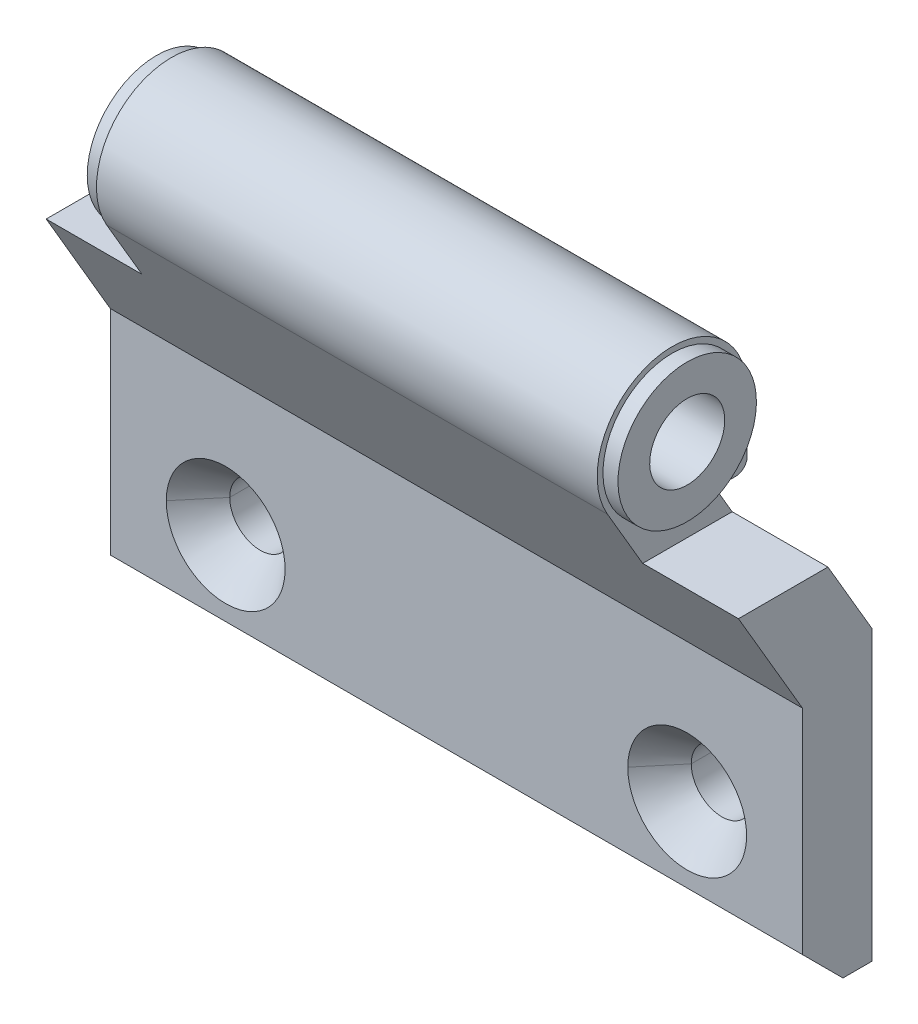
ISO-10303-21;
HEADER;
FILE_DESCRIPTION(('STEP AP214'),'2;1');
FILE_NAME('part.step','',(''),(''),'','','');
FILE_SCHEMA(('AUTOMOTIVE_DESIGN { 1 0 10303 214 1 1 1 1 }'));
ENDSEC;
DATA;
#1=APPLICATION_CONTEXT('core data for automotive mechanical design processes');
#2=APPLICATION_PROTOCOL_DEFINITION('international standard','automotive_design',2000,#1);
#3=PRODUCT_CONTEXT('',#1,'mechanical');
#4=PRODUCT('Part','Part','',(#3));
#5=PRODUCT_RELATED_PRODUCT_CATEGORY('part','',(#4));
#6=PRODUCT_DEFINITION_FORMATION('','',#4);
#7=PRODUCT_DEFINITION_CONTEXT('part definition',#1,'design');
#8=PRODUCT_DEFINITION('design','',#6,#7);
#9=PRODUCT_DEFINITION_SHAPE('','',#8);
#10=(LENGTH_UNIT() NAMED_UNIT(*) SI_UNIT(.MILLI.,.METRE.));
#11=(NAMED_UNIT(*) PLANE_ANGLE_UNIT() SI_UNIT($,.RADIAN.));
#12=(NAMED_UNIT(*) SI_UNIT($,.STERADIAN.) SOLID_ANGLE_UNIT());
#13=UNCERTAINTY_MEASURE_WITH_UNIT(LENGTH_MEASURE(1.E-05),#10,'distance_accuracy_value','');
#14=(GEOMETRIC_REPRESENTATION_CONTEXT(3) GLOBAL_UNCERTAINTY_ASSIGNED_CONTEXT((#13)) GLOBAL_UNIT_ASSIGNED_CONTEXT((#10,
#11,#12)) REPRESENTATION_CONTEXT('',''));
#15=CARTESIAN_POINT('',(0.,0.,0.));
#16=DIRECTION('',(0.,0.,1.));
#17=DIRECTION('',(1.,0.,0.));
#18=AXIS2_PLACEMENT_3D('',#15,#16,#17);
#19=CARTESIAN_POINT('',(40.,0.,6.3));
#20=DIRECTION('',(0.,0.,-1.));
#21=DIRECTION('',(-1.,0.,0.));
#22=AXIS2_PLACEMENT_3D('',#19,#20,#21);
#23=CYLINDRICAL_SURFACE('',#22,2.65);
#24=CARTESIAN_POINT('',(40.,0.,3.00000000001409));
#25=DIRECTION('',(0.,0.,1.));
#26=DIRECTION('',(-1.,0.,0.));
#27=AXIS2_PLACEMENT_3D('',#24,#25,#26);
#28=CIRCLE('',#27,2.64999999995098);
#29=CARTESIAN_POINT('',(42.6499999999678,0.,3.00000000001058));
#30=VERTEX_POINT('',#29);
#31=CARTESIAN_POINT('',(37.3500000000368,0.,3.00000000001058));
#32=VERTEX_POINT('',#31);
#33=EDGE_CURVE('E103',#30,#32,#28,.T.);
#34=ORIENTED_EDGE('',*,*,#33,.T.);
#35=DIRECTION('',(0.,0.,-1.));
#36=VECTOR('',#35,1.);
#37=CARTESIAN_POINT('',(37.35,0.,6.3));
#38=LINE('',#37,#36);
#39=CARTESIAN_POINT('',(37.35,0.,0.));
#40=VERTEX_POINT('',#39);
#41=EDGE_CURVE('E110',#32,#40,#38,.T.);
#42=ORIENTED_EDGE('',*,*,#41,.T.);
#43=CARTESIAN_POINT('',(40.,0.,0.));
#44=DIRECTION('',(0.,0.,-1.));
#45=DIRECTION('',(-1.,0.,0.));
#46=AXIS2_PLACEMENT_3D('',#43,#44,#45);
#47=CIRCLE('',#46,2.65);
#48=CARTESIAN_POINT('',(42.65,0.,0.));
#49=VERTEX_POINT('',#48);
#50=EDGE_CURVE('E88',#49,#40,#47,.F.);
#51=ORIENTED_EDGE('',*,*,#50,.F.);
#52=DIRECTION('',(0.,0.,-1.));
#53=VECTOR('',#52,1.);
#54=CARTESIAN_POINT('',(42.65,0.,6.3));
#55=LINE('',#54,#53);
#56=EDGE_CURVE('E105',#49,#30,#55,.F.);
#57=ORIENTED_EDGE('',*,*,#56,.T.);
#58=EDGE_LOOP('',(#34,#42,#51,#57));
#59=FACE_BOUND('',#58,.T.);
#60=ADVANCED_FACE('F14',(#59),#23,.F.);
#61=CARTESIAN_POINT('',(40.,0.,6.3));
#62=DIRECTION('',(0.,0.,-1.));
#63=DIRECTION('',(-1.,0.,0.));
#64=AXIS2_PLACEMENT_3D('',#61,#62,#63);
#65=CYLINDRICAL_SURFACE('',#64,2.65);
#66=CARTESIAN_POINT('',(40.,0.,3.00000000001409));
#67=DIRECTION('',(0.,0.,1.));
#68=DIRECTION('',(-1.,0.,0.));
#69=AXIS2_PLACEMENT_3D('',#66,#67,#68);
#70=CIRCLE('',#69,2.64999999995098);
#71=EDGE_CURVE('E115',#32,#30,#70,.T.);
#72=ORIENTED_EDGE('',*,*,#71,.T.);
#73=ORIENTED_EDGE('',*,*,#56,.F.);
#74=CARTESIAN_POINT('',(40.,0.,0.));
#75=DIRECTION('',(0.,0.,-1.));
#76=DIRECTION('',(-1.,0.,0.));
#77=AXIS2_PLACEMENT_3D('',#74,#75,#76);
#78=CIRCLE('',#77,2.65);
#79=EDGE_CURVE('E231',#40,#49,#78,.F.);
#80=ORIENTED_EDGE('',*,*,#79,.F.);
#81=ORIENTED_EDGE('',*,*,#41,.F.);
#82=EDGE_LOOP('',(#72,#73,#80,#81));
#83=FACE_BOUND('',#82,.T.);
#84=ADVANCED_FACE('F116',(#83),#65,.F.);
#85=CARTESIAN_POINT('',(0.,0.,6.3));
#86=DIRECTION('',(0.,0.,1.));
#87=DIRECTION('',(1.,0.,0.));
#88=AXIS2_PLACEMENT_3D('',#85,#86,#87);
#89=CYLINDRICAL_SURFACE('',#88,2.65);
#90=CARTESIAN_POINT('',(0.,0.,3.00000000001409));
#91=DIRECTION('',(0.,0.,1.));
#92=DIRECTION('',(-1.,0.,0.));
#93=AXIS2_PLACEMENT_3D('',#90,#91,#92);
#94=CIRCLE('',#93,2.65000000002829);
#95=CARTESIAN_POINT('',(2.6499999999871,0.,2.99999999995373));
#96=VERTEX_POINT('',#95);
#97=CARTESIAN_POINT('',(-2.6499999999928,0.,2.99999999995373));
#98=VERTEX_POINT('',#97);
#99=EDGE_CURVE('E132',#96,#98,#94,.T.);
#100=ORIENTED_EDGE('',*,*,#99,.T.);
#101=DIRECTION('',(0.,0.,1.));
#102=VECTOR('',#101,1.);
#103=CARTESIAN_POINT('',(-2.65,0.,6.3));
#104=LINE('',#103,#102);
#105=CARTESIAN_POINT('',(-2.65,0.,0.));
#106=VERTEX_POINT('',#105);
#107=EDGE_CURVE('E126',#98,#106,#104,.F.);
#108=ORIENTED_EDGE('',*,*,#107,.T.);
#109=CARTESIAN_POINT('',(0.,0.,0.));
#110=DIRECTION('',(0.,0.,1.));
#111=DIRECTION('',(1.,0.,0.));
#112=AXIS2_PLACEMENT_3D('',#109,#110,#111);
#113=CIRCLE('',#112,2.65);
#114=CARTESIAN_POINT('',(2.65,0.,0.));
#115=VERTEX_POINT('',#114);
#116=EDGE_CURVE('E228',#115,#106,#113,.T.);
#117=ORIENTED_EDGE('',*,*,#116,.F.);
#118=DIRECTION('',(0.,0.,1.));
#119=VECTOR('',#118,1.);
#120=CARTESIAN_POINT('',(2.65,0.,6.3));
#121=LINE('',#120,#119);
#122=EDGE_CURVE('E96',#115,#96,#121,.T.);
#123=ORIENTED_EDGE('',*,*,#122,.T.);
#124=EDGE_LOOP('',(#100,#108,#117,#123));
#125=FACE_BOUND('',#124,.T.);
#126=ADVANCED_FACE('F805',(#125),#89,.F.);
#127=CARTESIAN_POINT('',(0.,0.,6.3));
#128=DIRECTION('',(0.,0.,1.));
#129=DIRECTION('',(1.,0.,0.));
#130=AXIS2_PLACEMENT_3D('',#127,#128,#129);
#131=CYLINDRICAL_SURFACE('',#130,2.65);
#132=CARTESIAN_POINT('',(0.,0.,3.00000000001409));
#133=DIRECTION('',(0.,0.,1.));
#134=DIRECTION('',(-1.,0.,0.));
#135=AXIS2_PLACEMENT_3D('',#132,#133,#134);
#136=CIRCLE('',#135,2.65000000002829);
#137=EDGE_CURVE('E195',#98,#96,#136,.T.);
#138=ORIENTED_EDGE('',*,*,#137,.T.);
#139=ORIENTED_EDGE('',*,*,#122,.F.);
#140=CARTESIAN_POINT('',(0.,0.,0.));
#141=DIRECTION('',(0.,0.,1.));
#142=DIRECTION('',(1.,0.,0.));
#143=AXIS2_PLACEMENT_3D('',#140,#141,#142);
#144=CIRCLE('',#143,2.65);
#145=EDGE_CURVE('E190',#106,#115,#144,.T.);
#146=ORIENTED_EDGE('',*,*,#145,.F.);
#147=ORIENTED_EDGE('',*,*,#107,.F.);
#148=EDGE_LOOP('',(#138,#139,#146,#147));
#149=FACE_BOUND('',#148,.T.);
#150=ADVANCED_FACE('F350',(#149),#131,.F.);
#151=CARTESIAN_POINT('',(50.,-6.5,6.));
#152=DIRECTION('',(0.,-1.,0.));
#153=DIRECTION('',(-1.,0.,0.));
#154=AXIS2_PLACEMENT_3D('',#151,#152,#153);
#155=PLANE('',#154);
#156=DIRECTION('',(1.,0.,0.));
#157=VECTOR('',#156,1.);
#158=CARTESIAN_POINT('',(33.,-6.5,3.5));
#159=LINE('',#158,#157);
#160=CARTESIAN_POINT('',(7.,-6.5,3.5));
#161=VERTEX_POINT('',#160);
#162=CARTESIAN_POINT('',(33.,-6.5,3.5));
#163=VERTEX_POINT('',#162);
#164=EDGE_CURVE('E184',#161,#163,#159,.T.);
#165=ORIENTED_EDGE('',*,*,#164,.T.);
#166=DIRECTION('',(0.,0.,-1.));
#167=VECTOR('',#166,1.);
#168=CARTESIAN_POINT('',(33.,-6.5,0.));
#169=LINE('',#168,#167);
#170=CARTESIAN_POINT('',(33.,-6.5,0.));
#171=VERTEX_POINT('',#170);
#172=EDGE_CURVE('E181',#163,#171,#169,.T.);
#173=ORIENTED_EDGE('',*,*,#172,.T.);
#174=DIRECTION('',(-1.,0.,0.));
#175=VECTOR('',#174,1.);
#176=CARTESIAN_POINT('',(50.,-6.5,0.));
#177=LINE('',#176,#175);
#178=CARTESIAN_POINT('',(7.,-6.5,0.));
#179=VERTEX_POINT('',#178);
#180=EDGE_CURVE('E157',#179,#171,#177,.F.);
#181=ORIENTED_EDGE('',*,*,#180,.F.);
#182=DIRECTION('',(0.,0.,-1.));
#183=VECTOR('',#182,1.);
#184=CARTESIAN_POINT('',(7.,-6.5,3.5));
#185=LINE('',#184,#183);
#186=EDGE_CURVE('E163',#179,#161,#185,.F.);
#187=ORIENTED_EDGE('',*,*,#186,.T.);
#188=EDGE_LOOP('',(#165,#173,#181,#187));
#189=FACE_BOUND('',#188,.T.);
#190=ADVANCED_FACE('F264',(#189),#155,.F.);
#191=CARTESIAN_POINT('',(40.,0.,6.));
#192=DIRECTION('',(0.,0.,1.));
#193=DIRECTION('',(1.,0.,0.));
#194=AXIS2_PLACEMENT_3D('',#191,#192,#193);
#195=CONICAL_SURFACE('',#194,5.1499999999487,0.694738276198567);
#196=ORIENTED_EDGE('',*,*,#33,.F.);
#197=DIRECTION('',(-0.640184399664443,0.,-0.768221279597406));
#198=VECTOR('',#197,1.);
#199=CARTESIAN_POINT('',(415878.483333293,-5.09314812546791E-11,499006.));
#200=LINE('',#199,#198);
#201=CARTESIAN_POINT('',(45.1499999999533,0.,6.));
#202=VERTEX_POINT('',#201);
#203=EDGE_CURVE('E120',#30,#202,#200,.F.);
#204=ORIENTED_EDGE('',*,*,#203,.T.);
#205=CARTESIAN_POINT('',(40.,0.,6.));
#206=DIRECTION('',(0.,0.,1.));
#207=DIRECTION('',(1.,0.,0.));
#208=AXIS2_PLACEMENT_3D('',#205,#206,#207);
#209=CIRCLE('',#208,5.1499999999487);
#210=CARTESIAN_POINT('',(34.8500000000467,0.,6.));
#211=VERTEX_POINT('',#210);
#212=EDGE_CURVE('E219',#211,#202,#209,.F.);
#213=ORIENTED_EDGE('',*,*,#212,.F.);
#214=DIRECTION('',(0.640184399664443,0.,-0.768221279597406));
#215=VECTOR('',#214,1.);
#216=CARTESIAN_POINT('',(-415798.483333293,0.,499006.));
#217=LINE('',#216,#215);
#218=EDGE_CURVE('E121',#211,#32,#217,.T.);
#219=ORIENTED_EDGE('',*,*,#218,.T.);
#220=EDGE_LOOP('',(#196,#204,#213,#219));
#221=FACE_BOUND('',#220,.T.);
#222=ADVANCED_FACE('F124',(#221),#195,.F.);
#223=CARTESIAN_POINT('',(40.,0.,6.));
#224=DIRECTION('',(0.,0.,1.));
#225=DIRECTION('',(1.,0.,0.));
#226=AXIS2_PLACEMENT_3D('',#223,#224,#225);
#227=CONICAL_SURFACE('',#226,5.1499999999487,0.694738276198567);
#228=ORIENTED_EDGE('',*,*,#71,.F.);
#229=ORIENTED_EDGE('',*,*,#218,.F.);
#230=CARTESIAN_POINT('',(40.,0.,6.));
#231=DIRECTION('',(0.,0.,1.));
#232=DIRECTION('',(1.,0.,0.));
#233=AXIS2_PLACEMENT_3D('',#230,#231,#232);
#234=CIRCLE('',#233,5.1499999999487);
#235=EDGE_CURVE('E130',#202,#211,#234,.F.);
#236=ORIENTED_EDGE('',*,*,#235,.F.);
#237=ORIENTED_EDGE('',*,*,#203,.F.);
#238=EDGE_LOOP('',(#228,#229,#236,#237));
#239=FACE_BOUND('',#238,.T.);
#240=ADVANCED_FACE('F128',(#239),#227,.F.);
#241=CARTESIAN_POINT('',(0.,0.,5.99999999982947));
#242=DIRECTION('',(0.,0.,1.));
#243=DIRECTION('',(1.,0.,0.));
#244=AXIS2_PLACEMENT_3D('',#241,#242,#243);
#245=CONICAL_SURFACE('',#244,5.14999999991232,0.694738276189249);
#246=ORIENTED_EDGE('',*,*,#99,.F.);
#247=DIRECTION('',(-0.640184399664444,0.,-0.768221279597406));
#248=VECTOR('',#247,1.);
#249=CARTESIAN_POINT('',(415838.483333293,-5.09210729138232E-11,499006.));
#250=LINE('',#249,#248);
#251=CARTESIAN_POINT('',(5.15000000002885,0.,6.));
#252=VERTEX_POINT('',#251);
#253=EDGE_CURVE('E197',#96,#252,#250,.F.);
#254=ORIENTED_EDGE('',*,*,#253,.T.);
#255=CARTESIAN_POINT('',(0.,0.,6.));
#256=DIRECTION('',(0.,0.,1.));
#257=DIRECTION('',(1.,0.,0.));
#258=AXIS2_PLACEMENT_3D('',#255,#256,#257);
#259=CIRCLE('',#258,5.15000000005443);
#260=CARTESIAN_POINT('',(-5.15000000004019,0.,6.));
#261=VERTEX_POINT('',#260);
#262=EDGE_CURVE('E215',#261,#252,#259,.F.);
#263=ORIENTED_EDGE('',*,*,#262,.F.);
#264=DIRECTION('',(0.640184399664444,0.,-0.768221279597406));
#265=VECTOR('',#264,1.);
#266=CARTESIAN_POINT('',(-415838.483333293,0.,499006.));
#267=LINE('',#266,#265);
#268=EDGE_CURVE('E134',#261,#98,#267,.T.);
#269=ORIENTED_EDGE('',*,*,#268,.T.);
#270=EDGE_LOOP('',(#246,#254,#263,#269));
#271=FACE_BOUND('',#270,.T.);
#272=ADVANCED_FACE('F343',(#271),#245,.F.);
#273=CARTESIAN_POINT('',(0.,0.,5.99999999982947));
#274=DIRECTION('',(0.,0.,1.));
#275=DIRECTION('',(1.,0.,0.));
#276=AXIS2_PLACEMENT_3D('',#273,#274,#275);
#277=CONICAL_SURFACE('',#276,5.14999999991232,0.694738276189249);
#278=ORIENTED_EDGE('',*,*,#137,.F.);
#279=ORIENTED_EDGE('',*,*,#268,.F.);
#280=CARTESIAN_POINT('',(0.,0.,6.));
#281=DIRECTION('',(0.,0.,1.));
#282=DIRECTION('',(1.,0.,0.));
#283=AXIS2_PLACEMENT_3D('',#280,#281,#282);
#284=CIRCLE('',#283,5.15000000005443);
#285=EDGE_CURVE('E211',#252,#261,#284,.F.);
#286=ORIENTED_EDGE('',*,*,#285,.F.);
#287=ORIENTED_EDGE('',*,*,#253,.F.);
#288=EDGE_LOOP('',(#278,#279,#286,#287));
#289=FACE_BOUND('',#288,.T.);
#290=ADVANCED_FACE('F351',(#289),#277,.F.);
#291=CARTESIAN_POINT('',(50.,-10.,0.));
#292=DIRECTION('',(0.,-1.,0.));
#293=DIRECTION('',(-1.,0.,0.));
#294=AXIS2_PLACEMENT_3D('',#291,#292,#293);
#295=PLANE('',#294);
#296=DIRECTION('',(-1.,0.,0.));
#297=VECTOR('',#296,1.);
#298=CARTESIAN_POINT('',(50.,-10.,0.));
#299=LINE('',#298,#297);
#300=CARTESIAN_POINT('',(50.,-10.,0.));
#301=VERTEX_POINT('',#300);
#302=CARTESIAN_POINT('',(-10.,-10.,0.));
#303=VERTEX_POINT('',#302);
#304=EDGE_CURVE('E160',#301,#303,#299,.T.);
#305=ORIENTED_EDGE('',*,*,#304,.F.);
#306=DIRECTION('',(0.,0.,-1.));
#307=VECTOR('',#306,1.);
#308=CARTESIAN_POINT('',(50.,-10.,6.));
#309=LINE('',#308,#307);
#310=CARTESIAN_POINT('',(50.,-10.,2.5));
#311=VERTEX_POINT('',#310);
#312=EDGE_CURVE('E280',#301,#311,#309,.F.);
#313=ORIENTED_EDGE('',*,*,#312,.T.);
#314=DIRECTION('',(-1.,0.,0.));
#315=VECTOR('',#314,1.);
#316=CARTESIAN_POINT('',(50.,-10.,2.5));
#317=LINE('',#316,#315);
#318=CARTESIAN_POINT('',(-10.,-10.,2.5));
#319=VERTEX_POINT('',#318);
#320=EDGE_CURVE('E323',#319,#311,#317,.F.);
#321=ORIENTED_EDGE('',*,*,#320,.F.);
#322=DIRECTION('',(0.,0.,-1.));
#323=VECTOR('',#322,1.);
#324=CARTESIAN_POINT('',(-10.,-10.,6.));
#325=LINE('',#324,#323);
#326=EDGE_CURVE('E149',#303,#319,#325,.F.);
#327=ORIENTED_EDGE('',*,*,#326,.F.);
#328=EDGE_LOOP('',(#305,#313,#321,#327));
#329=FACE_BOUND('',#328,.T.);
#330=ADVANCED_FACE('F523',(#329),#295,.T.);
#331=CARTESIAN_POINT('',(50.,-6.5,6.));
#332=DIRECTION('',(0.,-0.707106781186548,0.707106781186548));
#333=DIRECTION('',(0.,0.707106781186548,0.707106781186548));
#334=AXIS2_PLACEMENT_3D('',#331,#332,#333);
#335=PLANE('',#334);
#336=DIRECTION('',(0.,0.707106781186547,0.707106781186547));
#337=VECTOR('',#336,1.);
#338=CARTESIAN_POINT('',(50.,-10.,2.5));
#339=LINE('',#338,#337);
#340=CARTESIAN_POINT('',(50.,-6.5,6.));
#341=VERTEX_POINT('',#340);
#342=EDGE_CURVE('E317',#311,#341,#339,.T.);
#343=ORIENTED_EDGE('',*,*,#342,.T.);
#344=DIRECTION('',(1.,0.,0.));
#345=VECTOR('',#344,1.);
#346=CARTESIAN_POINT('',(50.,-6.5,6.));
#347=LINE('',#346,#345);
#348=CARTESIAN_POINT('',(-10.,-6.5,6.));
#349=VERTEX_POINT('',#348);
#350=EDGE_CURVE('E221',#349,#341,#347,.T.);
#351=ORIENTED_EDGE('',*,*,#350,.F.);
#352=DIRECTION('',(0.,0.707106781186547,0.707106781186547));
#353=VECTOR('',#352,1.);
#354=CARTESIAN_POINT('',(-10.,-10.,2.5));
#355=LINE('',#354,#353);
#356=EDGE_CURVE('E145',#319,#349,#355,.T.);
#357=ORIENTED_EDGE('',*,*,#356,.F.);
#358=ORIENTED_EDGE('',*,*,#320,.T.);
#359=EDGE_LOOP('',(#343,#351,#357,#358));
#360=FACE_BOUND('',#359,.T.);
#361=ADVANCED_FACE('F237',(#360),#335,.T.);
#362=CARTESIAN_POINT('',(50.,15.,0.));
#363=DIRECTION('',(0.,0.,-1.));
#364=DIRECTION('',(-1.,0.,0.));
#365=AXIS2_PLACEMENT_3D('',#362,#363,#364);
#366=PLANE('',#365);
#367=ORIENTED_EDGE('',*,*,#116,.T.);
#368=ORIENTED_EDGE('',*,*,#145,.T.);
#369=EDGE_LOOP('',(#367,#368));
#370=FACE_BOUND('',#369,.T.);
#371=ORIENTED_EDGE('',*,*,#50,.T.);
#372=ORIENTED_EDGE('',*,*,#79,.T.);
#373=EDGE_LOOP('',(#371,#372));
#374=FACE_BOUND('',#373,.T.);
#375=DIRECTION('',(0.,1.,0.));
#376=VECTOR('',#375,1.);
#377=CARTESIAN_POINT('',(7.,-6.5,0.));
#378=LINE('',#377,#376);
#379=CARTESIAN_POINT('',(7.,15.,-3.0964814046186E-13));
#380=VERTEX_POINT('',#379);
#381=EDGE_CURVE('E167',#380,#179,#378,.F.);
#382=ORIENTED_EDGE('',*,*,#381,.T.);
#383=ORIENTED_EDGE('',*,*,#180,.T.);
#384=DIRECTION('',(0.,-1.,0.));
#385=VECTOR('',#384,1.);
#386=CARTESIAN_POINT('',(33.,-6.5,0.));
#387=LINE('',#386,#385);
#388=CARTESIAN_POINT('',(33.,15.,-1.196959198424E-13));
#389=VERTEX_POINT('',#388);
#390=EDGE_CURVE('E185',#171,#389,#387,.F.);
#391=ORIENTED_EDGE('',*,*,#390,.T.);
#392=DIRECTION('',(-1.,0.,0.));
#393=VECTOR('',#392,1.);
#394=CARTESIAN_POINT('',(50.,15.,-4.70110061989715E-13));
#395=LINE('',#394,#393);
#396=CARTESIAN_POINT('',(50.,15.,-3.0964814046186E-13));
#397=VERTEX_POINT('',#396);
#398=EDGE_CURVE('E283',#397,#389,#395,.T.);
#399=ORIENTED_EDGE('',*,*,#398,.F.);
#400=DIRECTION('',(0.,1.,0.));
#401=VECTOR('',#400,1.);
#402=CARTESIAN_POINT('',(50.,-10.,0.));
#403=LINE('',#402,#401);
#404=EDGE_CURVE('E214',#397,#301,#403,.F.);
#405=ORIENTED_EDGE('',*,*,#404,.T.);
#406=ORIENTED_EDGE('',*,*,#304,.T.);
#407=DIRECTION('',(0.,1.,0.));
#408=VECTOR('',#407,1.);
#409=CARTESIAN_POINT('',(-10.,-10.,0.));
#410=LINE('',#409,#408);
#411=CARTESIAN_POINT('',(-10.,15.,-3.0964814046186E-13));
#412=VERTEX_POINT('',#411);
#413=EDGE_CURVE('E154',#412,#303,#410,.F.);
#414=ORIENTED_EDGE('',*,*,#413,.F.);
#415=DIRECTION('',(-1.,0.,0.));
#416=VECTOR('',#415,1.);
#417=CARTESIAN_POINT('',(50.,15.,-4.70110061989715E-13));
#418=LINE('',#417,#416);
#419=EDGE_CURVE('E249',#380,#412,#418,.T.);
#420=ORIENTED_EDGE('',*,*,#419,.F.);
#421=EDGE_LOOP('',(#382,#383,#391,#399,#405,#406,#414,#420));
#422=FACE_BOUND('',#421,.T.);
#423=ADVANCED_FACE('F233',(#370,#374,#422),#366,.T.);
#424=CARTESIAN_POINT('',(33.,-6.5,0.));
#425=DIRECTION('',(1.,0.,0.));
#426=DIRECTION('',(0.,-1.,0.));
#427=AXIS2_PLACEMENT_3D('',#424,#425,#426);
#428=PLANE('',#427);
#429=DIRECTION('',(0.,1.,0.));
#430=VECTOR('',#429,1.);
#431=CARTESIAN_POINT('',(33.,-6.5,3.5));
#432=LINE('',#431,#430);
#433=CARTESIAN_POINT('',(33.,20.9825319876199,3.50000000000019));
#434=VERTEX_POINT('',#433);
#435=EDGE_CURVE('E256',#163,#434,#432,.T.);
#436=ORIENTED_EDGE('',*,*,#435,.T.);
#437=DIRECTION('',(0.,-0.863138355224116,-0.504967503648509));
#438=VECTOR('',#437,1.);
#439=CARTESIAN_POINT('',(33.,24.,5.2653291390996));
#440=LINE('',#439,#438);
#441=EDGE_CURVE('E286',#389,#434,#440,.F.);
#442=ORIENTED_EDGE('',*,*,#441,.F.);
#443=ORIENTED_EDGE('',*,*,#390,.F.);
#444=ORIENTED_EDGE('',*,*,#172,.F.);
#445=EDGE_LOOP('',(#436,#442,#443,#444));
#446=FACE_BOUND('',#445,.T.);
#447=ADVANCED_FACE('F236',(#446),#428,.F.);
#448=CARTESIAN_POINT('',(33.,-6.5,3.5));
#449=DIRECTION('',(0.,0.,1.));
#450=DIRECTION('',(1.,0.,0.));
#451=AXIS2_PLACEMENT_3D('',#448,#449,#450);
#452=PLANE('',#451);
#453=ORIENTED_EDGE('',*,*,#164,.F.);
#454=DIRECTION('',(0.,1.,0.));
#455=VECTOR('',#454,1.);
#456=CARTESIAN_POINT('',(7.,-6.5,3.5));
#457=LINE('',#456,#455);
#458=CARTESIAN_POINT('',(7.,20.9825319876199,3.50000000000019));
#459=VERTEX_POINT('',#458);
#460=EDGE_CURVE('E166',#161,#459,#457,.T.);
#461=ORIENTED_EDGE('',*,*,#460,.T.);
#462=DIRECTION('',(-1.,0.,0.));
#463=VECTOR('',#462,1.);
#464=CARTESIAN_POINT('',(50.,20.9825319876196,3.50000000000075));
#465=LINE('',#464,#463);
#466=EDGE_CURVE('E309',#434,#459,#465,.T.);
#467=ORIENTED_EDGE('',*,*,#466,.F.);
#468=ORIENTED_EDGE('',*,*,#435,.F.);
#469=EDGE_LOOP('',(#453,#461,#467,#468));
#470=FACE_BOUND('',#469,.T.);
#471=ADVANCED_FACE('F270',(#470),#452,.F.);
#472=CARTESIAN_POINT('',(7.,-6.5,3.5));
#473=DIRECTION('',(-1.,0.,0.));
#474=DIRECTION('',(0.,1.,0.));
#475=AXIS2_PLACEMENT_3D('',#472,#473,#474);
#476=PLANE('',#475);
#477=ORIENTED_EDGE('',*,*,#460,.F.);
#478=ORIENTED_EDGE('',*,*,#186,.F.);
#479=ORIENTED_EDGE('',*,*,#381,.F.);
#480=DIRECTION('',(0.,-0.863138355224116,-0.504967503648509));
#481=VECTOR('',#480,1.);
#482=CARTESIAN_POINT('',(7.,24.,5.2653291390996));
#483=LINE('',#482,#481);
#484=EDGE_CURVE('E306',#459,#380,#483,.T.);
#485=ORIENTED_EDGE('',*,*,#484,.F.);
#486=EDGE_LOOP('',(#477,#478,#479,#485));
#487=FACE_BOUND('',#486,.T.);
#488=ADVANCED_FACE('F259',(#487),#476,.F.);
#489=CARTESIAN_POINT('',(-10.12123523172,25.,3.5));
#490=DIRECTION('',(1.,0.,0.));
#491=DIRECTION('',(0.,-1.,0.));
#492=AXIS2_PLACEMENT_3D('',#489,#490,#491);
#493=CYLINDRICAL_SURFACE('',#492,1.);
#494=DIRECTION('',(-1.,0.,0.));
#495=VECTOR('',#494,1.);
#496=CARTESIAN_POINT('',(50.,25.,2.5));
#497=LINE('',#496,#495);
#498=CARTESIAN_POINT('',(41.7,25.,2.5));
#499=VERTEX_POINT('',#498);
#500=CARTESIAN_POINT('',(-1.7,25.,2.5));
#501=VERTEX_POINT('',#500);
#502=EDGE_CURVE('E415',#499,#501,#497,.T.);
#503=ORIENTED_EDGE('',*,*,#502,.F.);
#504=CARTESIAN_POINT('',(41.7,25.,3.5));
#505=DIRECTION('',(1.,0.,0.));
#506=DIRECTION('',(0.,-1.,0.));
#507=AXIS2_PLACEMENT_3D('',#504,#505,#506);
#508=CIRCLE('',#507,1.);
#509=CARTESIAN_POINT('',(41.7,24.,3.5));
#510=VERTEX_POINT('',#509);
#511=EDGE_CURVE('E222',#499,#510,#508,.F.);
#512=ORIENTED_EDGE('',*,*,#511,.T.);
#513=DIRECTION('',(-1.,0.,0.));
#514=VECTOR('',#513,1.);
#515=CARTESIAN_POINT('',(50.,24.,3.5));
#516=LINE('',#515,#514);
#517=CARTESIAN_POINT('',(-1.7,24.,3.5));
#518=VERTEX_POINT('',#517);
#519=EDGE_CURVE('E301',#518,#510,#516,.F.);
#520=ORIENTED_EDGE('',*,*,#519,.F.);
#521=CARTESIAN_POINT('',(-1.7,25.,3.5));
#522=DIRECTION('',(1.,0.,0.));
#523=DIRECTION('',(0.,-1.,0.));
#524=AXIS2_PLACEMENT_3D('',#521,#522,#523);
#525=CIRCLE('',#524,1.);
#526=EDGE_CURVE('E224',#518,#501,#525,.T.);
#527=ORIENTED_EDGE('',*,*,#526,.T.);
#528=EDGE_LOOP('',(#503,#512,#520,#527));
#529=FACE_BOUND('',#528,.T.);
#530=ADVANCED_FACE('F566',(#529),#493,.T.);
#531=CARTESIAN_POINT('',(-1.7,21.5,-1.550040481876));
#532=DIRECTION('',(0.,-1.,0.));
#533=DIRECTION('',(-1.,0.,0.));
#534=AXIS2_PLACEMENT_3D('',#531,#532,#533);
#535=PLANE('',#534);
#536=DIRECTION('',(0.,0.,-1.));
#537=VECTOR('',#536,1.);
#538=CARTESIAN_POINT('',(-1.7,21.5,-1.550040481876));
#539=LINE('',#538,#537);
#540=CARTESIAN_POINT('',(-1.7,21.5,11.5578474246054));
#541=VERTEX_POINT('',#540);
#542=CARTESIAN_POINT('',(-1.7,21.5,3.80273771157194));
#543=VERTEX_POINT('',#542);
#544=EDGE_CURVE('E411',#541,#543,#539,.T.);
#545=ORIENTED_EDGE('',*,*,#544,.T.);
#546=DIRECTION('',(-1.,0.,0.));
#547=VECTOR('',#546,1.);
#548=CARTESIAN_POINT('',(50.,21.5,3.80273771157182));
#549=LINE('',#548,#547);
#550=CARTESIAN_POINT('',(-10.,21.5,3.80273771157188));
#551=VERTEX_POINT('',#550);
#552=EDGE_CURVE('E293',#551,#543,#549,.F.);
#553=ORIENTED_EDGE('',*,*,#552,.F.);
#554=DIRECTION('',(0.,0.,-1.));
#555=VECTOR('',#554,1.);
#556=CARTESIAN_POINT('',(-10.,21.5,6.));
#557=LINE('',#556,#555);
#558=CARTESIAN_POINT('',(-10.,21.5,11.5578474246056));
#559=VERTEX_POINT('',#558);
#560=EDGE_CURVE('E148',#559,#551,#557,.T.);
#561=ORIENTED_EDGE('',*,*,#560,.F.);
#562=DIRECTION('',(-1.,0.,0.));
#563=VECTOR('',#562,1.);
#564=CARTESIAN_POINT('',(50.,21.4999999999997,11.5578474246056));
#565=LINE('',#564,#563);
#566=EDGE_CURVE('E399',#541,#559,#565,.T.);
#567=ORIENTED_EDGE('',*,*,#566,.F.);
#568=EDGE_LOOP('',(#545,#553,#561,#567));
#569=FACE_BOUND('',#568,.T.);
#570=ADVANCED_FACE('F574',(#569),#535,.F.);
#571=CARTESIAN_POINT('',(-10.,-10.,6.));
#572=DIRECTION('',(-1.,0.,0.));
#573=DIRECTION('',(0.,1.,0.));
#574=AXIS2_PLACEMENT_3D('',#571,#572,#573);
#575=PLANE('',#574);
#576=DIRECTION('',(0.,0.863138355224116,0.504967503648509));
#577=VECTOR('',#576,1.);
#578=CARTESIAN_POINT('',(-10.,12.,6.));
#579=LINE('',#578,#577);
#580=CARTESIAN_POINT('',(-10.,12.,6.));
#581=VERTEX_POINT('',#580);
#582=EDGE_CURVE('E391',#559,#581,#579,.F.);
#583=ORIENTED_EDGE('',*,*,#582,.F.);
#584=ORIENTED_EDGE('',*,*,#560,.T.);
#585=DIRECTION('',(0.,-0.863138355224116,-0.504967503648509));
#586=VECTOR('',#585,1.);
#587=CARTESIAN_POINT('',(-10.,24.,5.2653291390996));
#588=LINE('',#587,#586);
#589=EDGE_CURVE('E290',#412,#551,#588,.F.);
#590=ORIENTED_EDGE('',*,*,#589,.F.);
#591=ORIENTED_EDGE('',*,*,#413,.T.);
#592=ORIENTED_EDGE('',*,*,#326,.T.);
#593=ORIENTED_EDGE('',*,*,#356,.T.);
#594=DIRECTION('',(0.,1.,0.));
#595=VECTOR('',#594,1.);
#596=CARTESIAN_POINT('',(-10.,-10.,6.));
#597=LINE('',#596,#595);
#598=EDGE_CURVE('E314',#581,#349,#597,.F.);
#599=ORIENTED_EDGE('',*,*,#598,.F.);
#600=EDGE_LOOP('',(#583,#584,#590,#591,#592,#593,#599));
#601=FACE_BOUND('',#600,.T.);
#602=ADVANCED_FACE('F357',(#601),#575,.T.);
#603=CARTESIAN_POINT('',(50.,-10.,6.));
#604=DIRECTION('',(0.,0.,1.));
#605=DIRECTION('',(1.,0.,0.));
#606=AXIS2_PLACEMENT_3D('',#603,#604,#605);
#607=PLANE('',#606);
#608=ORIENTED_EDGE('',*,*,#262,.T.);
#609=ORIENTED_EDGE('',*,*,#285,.T.);
#610=EDGE_LOOP('',(#608,#609));
#611=FACE_BOUND('',#610,.T.);
#612=ORIENTED_EDGE('',*,*,#212,.T.);
#613=ORIENTED_EDGE('',*,*,#235,.T.);
#614=EDGE_LOOP('',(#612,#613));
#615=FACE_BOUND('',#614,.T.);
#616=ORIENTED_EDGE('',*,*,#350,.T.);
#617=DIRECTION('',(0.,1.,0.));
#618=VECTOR('',#617,1.);
#619=CARTESIAN_POINT('',(50.,-10.,6.));
#620=LINE('',#619,#618);
#621=CARTESIAN_POINT('',(50.,12.,6.));
#622=VERTEX_POINT('',#621);
#623=EDGE_CURVE('E320',#341,#622,#620,.T.);
#624=ORIENTED_EDGE('',*,*,#623,.T.);
#625=DIRECTION('',(-1.,0.,0.));
#626=VECTOR('',#625,1.);
#627=CARTESIAN_POINT('',(50.,12.,6.));
#628=LINE('',#627,#626);
#629=EDGE_CURVE('E389',#581,#622,#628,.F.);
#630=ORIENTED_EDGE('',*,*,#629,.F.);
#631=ORIENTED_EDGE('',*,*,#598,.T.);
#632=EDGE_LOOP('',(#616,#624,#630,#631));
#633=FACE_BOUND('',#632,.T.);
#634=ADVANCED_FACE('F353',(#611,#615,#633),#607,.T.);
#635=CARTESIAN_POINT('',(50.,-10.,6.));
#636=DIRECTION('',(-1.,0.,0.));
#637=DIRECTION('',(0.,1.,0.));
#638=AXIS2_PLACEMENT_3D('',#635,#636,#637);
#639=PLANE('',#638);
#640=ORIENTED_EDGE('',*,*,#623,.F.);
#641=ORIENTED_EDGE('',*,*,#342,.F.);
#642=ORIENTED_EDGE('',*,*,#312,.F.);
#643=ORIENTED_EDGE('',*,*,#404,.F.);
#644=DIRECTION('',(0.,-0.863138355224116,-0.504967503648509));
#645=VECTOR('',#644,1.);
#646=CARTESIAN_POINT('',(50.,24.,5.2653291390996));
#647=LINE('',#646,#645);
#648=CARTESIAN_POINT('',(50.,21.5,3.80273771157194));
#649=VERTEX_POINT('',#648);
#650=EDGE_CURVE('E287',#649,#397,#647,.T.);
#651=ORIENTED_EDGE('',*,*,#650,.F.);
#652=DIRECTION('',(0.,0.,-1.));
#653=VECTOR('',#652,1.);
#654=CARTESIAN_POINT('',(50.,21.5,-1.550040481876));
#655=LINE('',#654,#653);
#656=CARTESIAN_POINT('',(50.,21.5,11.5578474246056));
#657=VERTEX_POINT('',#656);
#658=EDGE_CURVE('E308',#649,#657,#655,.F.);
#659=ORIENTED_EDGE('',*,*,#658,.T.);
#660=DIRECTION('',(0.,0.863138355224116,0.504967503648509));
#661=VECTOR('',#660,1.);
#662=CARTESIAN_POINT('',(50.,12.,6.));
#663=LINE('',#662,#661);
#664=EDGE_CURVE('E378',#622,#657,#663,.T.);
#665=ORIENTED_EDGE('',*,*,#664,.F.);
#666=EDGE_LOOP('',(#640,#641,#642,#643,#651,#659,#665));
#667=FACE_BOUND('',#666,.T.);
#668=ADVANCED_FACE('F356',(#667),#639,.F.);
#669=CARTESIAN_POINT('',(50.,24.,2.5));
#670=DIRECTION('',(0.,-1.,0.));
#671=DIRECTION('',(-1.,0.,0.));
#672=AXIS2_PLACEMENT_3D('',#669,#670,#671);
#673=PLANE('',#672);
#674=ORIENTED_EDGE('',*,*,#519,.T.);
#675=DIRECTION('',(0.,0.,-1.));
#676=VECTOR('',#675,1.);
#677=CARTESIAN_POINT('',(41.7,24.,-1.550040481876));
#678=LINE('',#677,#676);
#679=CARTESIAN_POINT('',(41.7,24.,5.2653291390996));
#680=VERTEX_POINT('',#679);
#681=EDGE_CURVE('E455',#510,#680,#678,.F.);
#682=ORIENTED_EDGE('',*,*,#681,.T.);
#683=DIRECTION('',(-1.,0.,0.));
#684=VECTOR('',#683,1.);
#685=CARTESIAN_POINT('',(50.,24.,5.2653291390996));
#686=LINE('',#685,#684);
#687=CARTESIAN_POINT('',(-1.7,24.,5.2653291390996));
#688=VERTEX_POINT('',#687);
#689=EDGE_CURVE('E425',#688,#680,#686,.F.);
#690=ORIENTED_EDGE('',*,*,#689,.F.);
#691=DIRECTION('',(0.,0.,-1.));
#692=VECTOR('',#691,1.);
#693=CARTESIAN_POINT('',(-1.7,24.,-1.550040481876));
#694=LINE('',#693,#692);
#695=EDGE_CURVE('E420',#688,#518,#694,.T.);
#696=ORIENTED_EDGE('',*,*,#695,.T.);
#697=EDGE_LOOP('',(#674,#682,#690,#696));
#698=FACE_BOUND('',#697,.T.);
#699=ADVANCED_FACE('F557',(#698),#673,.T.);
#700=CARTESIAN_POINT('',(50.,24.,5.2653291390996));
#701=DIRECTION('',(0.,0.504967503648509,-0.863138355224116));
#702=DIRECTION('',(0.,-0.863138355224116,-0.504967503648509));
#703=AXIS2_PLACEMENT_3D('',#700,#701,#702);
#704=PLANE('',#703);
#705=ORIENTED_EDGE('',*,*,#466,.T.);
#706=ORIENTED_EDGE('',*,*,#484,.T.);
#707=ORIENTED_EDGE('',*,*,#419,.T.);
#708=ORIENTED_EDGE('',*,*,#589,.T.);
#709=ORIENTED_EDGE('',*,*,#552,.T.);
#710=DIRECTION('',(0.,0.863138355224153,0.504967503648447));
#711=VECTOR('',#710,1.);
#712=CARTESIAN_POINT('',(-1.7,21.5,3.802737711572));
#713=LINE('',#712,#711);
#714=EDGE_CURVE('E414',#543,#688,#713,.T.);
#715=ORIENTED_EDGE('',*,*,#714,.T.);
#716=ORIENTED_EDGE('',*,*,#689,.T.);
#717=DIRECTION('',(0.,-0.863138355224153,-0.504967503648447));
#718=VECTOR('',#717,1.);
#719=CARTESIAN_POINT('',(41.7,24.,5.2653291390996));
#720=LINE('',#719,#718);
#721=CARTESIAN_POINT('',(41.7,21.5,3.802737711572));
#722=VERTEX_POINT('',#721);
#723=EDGE_CURVE('E466',#680,#722,#720,.T.);
#724=ORIENTED_EDGE('',*,*,#723,.T.);
#725=DIRECTION('',(-1.,0.,0.));
#726=VECTOR('',#725,1.);
#727=CARTESIAN_POINT('',(50.,21.5,3.802737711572));
#728=LINE('',#727,#726);
#729=EDGE_CURVE('E447',#722,#649,#728,.F.);
#730=ORIENTED_EDGE('',*,*,#729,.T.);
#731=ORIENTED_EDGE('',*,*,#650,.T.);
#732=ORIENTED_EDGE('',*,*,#398,.T.);
#733=ORIENTED_EDGE('',*,*,#441,.T.);
#734=EDGE_LOOP('',(#705,#706,#707,#708,#709,#715,#716,#724,#730,#731,#732,#733));
#735=FACE_BOUND('',#734,.T.);
#736=ADVANCED_FACE('F478',(#735),#704,.T.);
#737=CARTESIAN_POINT('',(50.,21.5,-1.550040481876));
#738=DIRECTION('',(0.,-1.,0.));
#739=DIRECTION('',(-1.,0.,0.));
#740=AXIS2_PLACEMENT_3D('',#737,#738,#739);
#741=PLANE('',#740);
#742=DIRECTION('',(0.,0.,-1.));
#743=VECTOR('',#742,1.);
#744=CARTESIAN_POINT('',(41.7,21.5,-1.550040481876));
#745=LINE('',#744,#743);
#746=CARTESIAN_POINT('',(41.7,21.5,11.5578474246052));
#747=VERTEX_POINT('',#746);
#748=EDGE_CURVE('E463',#722,#747,#745,.F.);
#749=ORIENTED_EDGE('',*,*,#748,.T.);
#750=DIRECTION('',(-1.,0.,0.));
#751=VECTOR('',#750,1.);
#752=CARTESIAN_POINT('',(50.,21.4999999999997,11.5578474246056));
#753=LINE('',#752,#751);
#754=EDGE_CURVE('E450',#657,#747,#753,.T.);
#755=ORIENTED_EDGE('',*,*,#754,.F.);
#756=ORIENTED_EDGE('',*,*,#658,.F.);
#757=ORIENTED_EDGE('',*,*,#729,.F.);
#758=EDGE_LOOP('',(#749,#755,#756,#757));
#759=FACE_BOUND('',#758,.T.);
#760=ADVANCED_FACE('F531',(#759),#741,.F.);
#761=CARTESIAN_POINT('',(50.,30.,2.5));
#762=DIRECTION('',(0.,0.,-1.));
#763=DIRECTION('',(-1.,0.,0.));
#764=AXIS2_PLACEMENT_3D('',#761,#762,#763);
#765=PLANE('',#764);
#766=DIRECTION('',(-1.,0.,0.));
#767=VECTOR('',#766,1.);
#768=CARTESIAN_POINT('',(50.,30.,2.5));
#769=LINE('',#768,#767);
#770=CARTESIAN_POINT('',(41.7,30.,2.5));
#771=VERTEX_POINT('',#770);
#772=CARTESIAN_POINT('',(-1.7,30.,2.5));
#773=VERTEX_POINT('',#772);
#774=EDGE_CURVE('E210',#771,#773,#769,.T.);
#775=ORIENTED_EDGE('',*,*,#774,.F.);
#776=DIRECTION('',(0.,1.,0.));
#777=VECTOR('',#776,1.);
#778=CARTESIAN_POINT('',(41.7,21.5,2.5));
#779=LINE('',#778,#777);
#780=EDGE_CURVE('E451',#771,#499,#779,.F.);
#781=ORIENTED_EDGE('',*,*,#780,.T.);
#782=ORIENTED_EDGE('',*,*,#502,.T.);
#783=DIRECTION('',(0.,-1.,0.));
#784=VECTOR('',#783,1.);
#785=CARTESIAN_POINT('',(-1.7,36.5,2.5));
#786=LINE('',#785,#784);
#787=EDGE_CURVE('E551',#501,#773,#786,.F.);
#788=ORIENTED_EDGE('',*,*,#787,.T.);
#789=EDGE_LOOP('',(#775,#781,#782,#788));
#790=FACE_BOUND('',#789,.T.);
#791=ADVANCED_FACE('F604',(#790),#765,.T.);
#792=CARTESIAN_POINT('',(-1.7,36.5,-1.550040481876));
#793=DIRECTION('',(1.,0.,0.));
#794=DIRECTION('',(0.,-1.,0.));
#795=AXIS2_PLACEMENT_3D('',#792,#793,#794);
#796=PLANE('',#795);
#797=CARTESIAN_POINT('',(-1.7,30.,9.));
#798=DIRECTION('',(1.,0.,0.));
#799=DIRECTION('',(0.,-1.,0.));
#800=AXIS2_PLACEMENT_3D('',#797,#798,#799);
#801=CIRCLE('',#800,6.);
#802=CARTESIAN_POINT('',(-1.7,24.,9.));
#803=VERTEX_POINT('',#802);
#804=EDGE_CURVE('E9',#803,#803,#801,.F.);
#805=ORIENTED_EDGE('',*,*,#804,.F.);
#806=EDGE_LOOP('',(#805));
#807=FACE_BOUND('',#806,.T.);
#808=ORIENTED_EDGE('',*,*,#526,.F.);
#809=ORIENTED_EDGE('',*,*,#695,.F.);
#810=ORIENTED_EDGE('',*,*,#714,.F.);
#811=ORIENTED_EDGE('',*,*,#544,.F.);
#812=DIRECTION('',(0.,0.863138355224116,0.504967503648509));
#813=VECTOR('',#812,1.);
#814=CARTESIAN_POINT('',(-1.7,12.,6.));
#815=LINE('',#814,#813);
#816=CARTESIAN_POINT('',(-1.7,26.7177112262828,14.6103993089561));
#817=VERTEX_POINT('',#816);
#818=EDGE_CURVE('E408',#817,#541,#815,.F.);
#819=ORIENTED_EDGE('',*,*,#818,.F.);
#820=CARTESIAN_POINT('',(-1.7,30.,9.));
#821=DIRECTION('',(-1.,0.,0.));
#822=DIRECTION('',(0.,1.,0.));
#823=AXIS2_PLACEMENT_3D('',#820,#821,#822);
#824=CIRCLE('',#823,6.5);
#825=EDGE_CURVE('E207',#773,#817,#824,.F.);
#826=ORIENTED_EDGE('',*,*,#825,.F.);
#827=ORIENTED_EDGE('',*,*,#787,.F.);
#828=EDGE_LOOP('',(#808,#809,#810,#811,#819,#826,#827));
#829=FACE_BOUND('',#828,.T.);
#830=ADVANCED_FACE('F561',(#807,#829),#796,.F.);
#831=CARTESIAN_POINT('',(50.,12.,6.));
#832=DIRECTION('',(0.,-0.504967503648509,0.863138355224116));
#833=DIRECTION('',(0.,0.863138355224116,0.504967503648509));
#834=AXIS2_PLACEMENT_3D('',#831,#832,#833);
#835=PLANE('',#834);
#836=ORIENTED_EDGE('',*,*,#664,.T.);
#837=ORIENTED_EDGE('',*,*,#754,.T.);
#838=DIRECTION('',(0.,0.863138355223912,0.504967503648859));
#839=VECTOR('',#838,1.);
#840=CARTESIAN_POINT('',(41.7,21.5,11.557847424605));
#841=LINE('',#840,#839);
#842=CARTESIAN_POINT('',(41.7,26.7177112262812,14.6103993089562));
#843=VERTEX_POINT('',#842);
#844=EDGE_CURVE('E30',#747,#843,#841,.T.);
#845=ORIENTED_EDGE('',*,*,#844,.T.);
#846=DIRECTION('',(-1.,0.,0.));
#847=VECTOR('',#846,1.);
#848=CARTESIAN_POINT('',(50.,26.7177112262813,14.6103993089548));
#849=LINE('',#848,#847);
#850=EDGE_CURVE('E206',#817,#843,#849,.F.);
#851=ORIENTED_EDGE('',*,*,#850,.F.);
#852=ORIENTED_EDGE('',*,*,#818,.T.);
#853=ORIENTED_EDGE('',*,*,#566,.T.);
#854=ORIENTED_EDGE('',*,*,#582,.T.);
#855=ORIENTED_EDGE('',*,*,#629,.T.);
#856=EDGE_LOOP('',(#836,#837,#845,#851,#852,#853,#854,#855));
#857=FACE_BOUND('',#856,.T.);
#858=ADVANCED_FACE('F570',(#857),#835,.T.);
#859=CARTESIAN_POINT('',(41.7,21.5,-1.550040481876));
#860=DIRECTION('',(-1.,0.,0.));
#861=DIRECTION('',(0.,1.,0.));
#862=AXIS2_PLACEMENT_3D('',#859,#860,#861);
#863=PLANE('',#862);
#864=CARTESIAN_POINT('',(41.7,30.,9.));
#865=DIRECTION('',(-1.,0.,0.));
#866=DIRECTION('',(0.,1.,0.));
#867=AXIS2_PLACEMENT_3D('',#864,#865,#866);
#868=CIRCLE('',#867,6.);
#869=CARTESIAN_POINT('',(41.7,36.,9.));
#870=VERTEX_POINT('',#869);
#871=EDGE_CURVE('E771',#870,#870,#868,.T.);
#872=ORIENTED_EDGE('',*,*,#871,.T.);
#873=EDGE_LOOP('',(#872));
#874=FACE_BOUND('',#873,.T.);
#875=ORIENTED_EDGE('',*,*,#748,.F.);
#876=ORIENTED_EDGE('',*,*,#723,.F.);
#877=ORIENTED_EDGE('',*,*,#681,.F.);
#878=ORIENTED_EDGE('',*,*,#511,.F.);
#879=ORIENTED_EDGE('',*,*,#780,.F.);
#880=CARTESIAN_POINT('',(41.7,30.,9.));
#881=DIRECTION('',(-1.,0.,0.));
#882=DIRECTION('',(0.,1.,0.));
#883=AXIS2_PLACEMENT_3D('',#880,#881,#882);
#884=CIRCLE('',#883,6.5);
#885=EDGE_CURVE('E22',#843,#771,#884,.T.);
#886=ORIENTED_EDGE('',*,*,#885,.F.);
#887=ORIENTED_EDGE('',*,*,#844,.F.);
#888=EDGE_LOOP('',(#875,#876,#877,#878,#879,#886,#887));
#889=FACE_BOUND('',#888,.T.);
#890=ADVANCED_FACE('F533',(#874,#889),#863,.F.);
#891=CARTESIAN_POINT('',(50.,30.,9.));
#892=DIRECTION('',(-1.,0.,0.));
#893=DIRECTION('',(0.,1.,0.));
#894=AXIS2_PLACEMENT_3D('',#891,#892,#893);
#895=CYLINDRICAL_SURFACE('',#894,6.5);
#896=ORIENTED_EDGE('',*,*,#850,.T.);
#897=ORIENTED_EDGE('',*,*,#885,.T.);
#898=ORIENTED_EDGE('',*,*,#774,.T.);
#899=ORIENTED_EDGE('',*,*,#825,.T.);
#900=EDGE_LOOP('',(#896,#897,#898,#899));
#901=FACE_BOUND('',#900,.T.);
#902=ADVANCED_FACE('F569',(#901),#895,.T.);
#903=CARTESIAN_POINT('',(-3.,30.,9.));
#904=DIRECTION('',(-1.,0.,0.));
#905=DIRECTION('',(0.,1.,0.));
#906=AXIS2_PLACEMENT_3D('',#903,#904,#905);
#907=PLANE('',#906);
#908=CARTESIAN_POINT('',(-3.,30.,9.));
#909=DIRECTION('',(-1.,0.,0.));
#910=DIRECTION('',(0.,1.,0.));
#911=AXIS2_PLACEMENT_3D('',#908,#909,#910);
#912=CIRCLE('',#911,6.);
#913=CARTESIAN_POINT('',(-3.,36.,9.));
#914=VERTEX_POINT('',#913);
#915=EDGE_CURVE('E111',#914,#914,#912,.T.);
#916=ORIENTED_EDGE('',*,*,#915,.T.);
#917=EDGE_LOOP('',(#916));
#918=FACE_BOUND('',#917,.T.);
#919=CARTESIAN_POINT('',(-3.,30.,9.));
#920=DIRECTION('',(-1.,0.,0.));
#921=DIRECTION('',(0.,1.,0.));
#922=AXIS2_PLACEMENT_3D('',#919,#920,#921);
#923=CIRCLE('',#922,3.25);
#924=CARTESIAN_POINT('',(-3.,33.25,9.));
#925=VERTEX_POINT('',#924);
#926=EDGE_CURVE('E769',#925,#925,#923,.T.);
#927=ORIENTED_EDGE('',*,*,#926,.F.);
#928=EDGE_LOOP('',(#927));
#929=FACE_BOUND('',#928,.T.);
#930=ADVANCED_FACE('F586',(#918,#929),#907,.T.);
#931=CARTESIAN_POINT('',(-3.,30.,9.));
#932=DIRECTION('',(1.,0.,0.));
#933=DIRECTION('',(0.,-1.,0.));
#934=AXIS2_PLACEMENT_3D('',#931,#932,#933);
#935=CYLINDRICAL_SURFACE('',#934,6.);
#936=ORIENTED_EDGE('',*,*,#915,.F.);
#937=EDGE_LOOP('',(#936));
#938=FACE_BOUND('',#937,.T.);
#939=ORIENTED_EDGE('',*,*,#804,.T.);
#940=EDGE_LOOP('',(#939));
#941=FACE_BOUND('',#940,.T.);
#942=ADVANCED_FACE('F593',(#938,#941),#935,.T.);
#943=CARTESIAN_POINT('',(-3.,30.,9.));
#944=DIRECTION('',(1.,0.,0.));
#945=DIRECTION('',(0.,-1.,0.));
#946=AXIS2_PLACEMENT_3D('',#943,#944,#945);
#947=CYLINDRICAL_SURFACE('',#946,3.25);
#948=ORIENTED_EDGE('',*,*,#926,.T.);
#949=EDGE_LOOP('',(#948));
#950=FACE_BOUND('',#949,.T.);
#951=CARTESIAN_POINT('',(43.,30.,9.));
#952=DIRECTION('',(-1.,0.,0.));
#953=DIRECTION('',(0.,1.,0.));
#954=AXIS2_PLACEMENT_3D('',#951,#952,#953);
#955=CIRCLE('',#954,3.25);
#956=CARTESIAN_POINT('',(43.,33.25,9.));
#957=VERTEX_POINT('',#956);
#958=EDGE_CURVE('E779',#957,#957,#955,.T.);
#959=ORIENTED_EDGE('',*,*,#958,.F.);
#960=EDGE_LOOP('',(#959));
#961=FACE_BOUND('',#960,.T.);
#962=ADVANCED_FACE('F745',(#950,#961),#947,.F.);
#963=CARTESIAN_POINT('',(43.,30.,9.));
#964=DIRECTION('',(-1.,0.,0.));
#965=DIRECTION('',(0.,1.,0.));
#966=AXIS2_PLACEMENT_3D('',#963,#964,#965);
#967=CYLINDRICAL_SURFACE('',#966,6.);
#968=CARTESIAN_POINT('',(43.,30.,9.));
#969=DIRECTION('',(-1.,0.,0.));
#970=DIRECTION('',(0.,1.,0.));
#971=AXIS2_PLACEMENT_3D('',#968,#969,#970);
#972=CIRCLE('',#971,6.);
#973=CARTESIAN_POINT('',(43.,36.,9.));
#974=VERTEX_POINT('',#973);
#975=EDGE_CURVE('E774',#974,#974,#972,.T.);
#976=ORIENTED_EDGE('',*,*,#975,.T.);
#977=EDGE_LOOP('',(#976));
#978=FACE_BOUND('',#977,.T.);
#979=ORIENTED_EDGE('',*,*,#871,.F.);
#980=EDGE_LOOP('',(#979));
#981=FACE_BOUND('',#980,.T.);
#982=ADVANCED_FACE('F735',(#978,#981),#967,.T.);
#983=CARTESIAN_POINT('',(43.,30.,9.));
#984=DIRECTION('',(-1.,0.,0.));
#985=DIRECTION('',(0.,1.,0.));
#986=AXIS2_PLACEMENT_3D('',#983,#984,#985);
#987=PLANE('',#986);
#988=ORIENTED_EDGE('',*,*,#958,.T.);
#989=EDGE_LOOP('',(#988));
#990=FACE_BOUND('',#989,.T.);
#991=ORIENTED_EDGE('',*,*,#975,.F.);
#992=EDGE_LOOP('',(#991));
#993=FACE_BOUND('',#992,.T.);
#994=ADVANCED_FACE('F730',(#990,#993),#987,.F.);
#995=CLOSED_SHELL('',(#60,#84,#126,#150,#190,#222,#240,#272,#290,#330,#361,#423,#447,#471,#488,
#530,#570,#602,#634,#668,#699,#736,#760,#791,#830,#858,#890,#902,#930,#942,#962,#982,#994));
#996=MANIFOLD_SOLID_BREP('B1',#995);
#997=ADVANCED_BREP_SHAPE_REPRESENTATION('',(#18,#996),#14);
#998=SHAPE_DEFINITION_REPRESENTATION(#9,#997);
ENDSEC;
END-ISO-10303-21;
